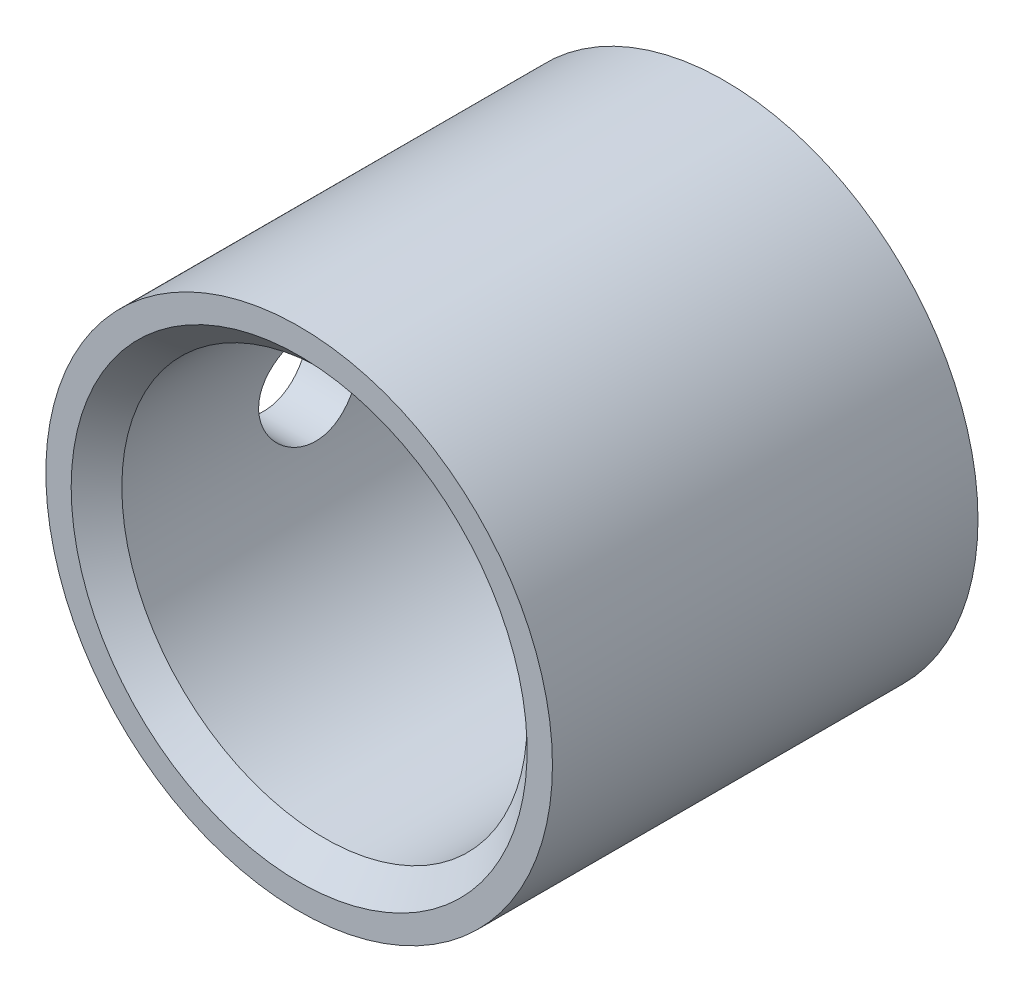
from build123d import *

# Parameters (mm, degrees)
ESQUISSE1_R             = 2.5
BASE_EXTRUSION_DEPTH    = 4.2
ESQUISSE2_R             = 2.25
ENL_V_MAT_EXTRU_1_DEPTH = 0.25
ENL_V_MAT_EXTRU_1_DRAFT = -45
ESQUISSE3_R             = 2
ENL_V_MAT_EXTRU_2_DEPTH = 3.7
ESQUISSE4_R             = 2.25
ENL_V_MAT_EXTRU_3_DEPTH = 0.25
ENL_V_MAT_EXTRU_3_DRAFT = -45
ESQUISSE5_R             = 0.5
ENL_V_MAT_EXTRU_4_DEPTH = 6.489990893


with BuildPart() as part:
    # Esquisse1 → Base-Extrusion (new body)
    with BuildSketch(Plane(origin=(0, 0, -4.2), x_dir=(-1, 0, 0), z_dir=(0, 0, -1))):
        with Locations(Location((0, 0, 0), (0, 0, 180))):
            Circle(ESQUISSE1_R)
    extrude(amount=-BASE_EXTRUSION_DEPTH)


with BuildPart() as enl_v_mat_extru_1_tool:
    # Esquisse2 → Enl_v. mat.-Extru.1 (with draft: the straight prism first)
    with BuildSketch(Plane(origin=(0, 0, -4.2), x_dir=(-1, 0, 0), z_dir=(0, 0, -1))):
        Circle(ESQUISSE2_R)
    extrude(amount=-ENL_V_MAT_EXTRU_1_DEPTH)
    # Enl_v. mat.-Extru.1: the draft: its side faces are tilted about the plane it starts from
    enl_v_mat_extru_1_sides = [enl_v_mat_extru_1_tool.faces().sort_by_distance(p)[0] for p in [
        (2.25, 0, -4.075),
    ]]
    draft(enl_v_mat_extru_1_sides, Plane(origin=(0, 0, -4.2), x_dir=(-1, 0, 0), z_dir=(0, 0, -1)), ENL_V_MAT_EXTRU_1_DRAFT)


with BuildPart() as part_1:
    add(part.part)

    # Enl_v. mat.-Extru.1: cut by enl_v_mat_extru_1_tool
    add(enl_v_mat_extru_1_tool.part, mode=Mode.SUBTRACT)

    # Esquisse3 → Enl_v. mat.-Extru.2 (cut)
    with BuildSketch(Plane(origin=(0, 0, -3.95), x_dir=(-1, 0, 0), z_dir=(0, 0, -1))):
        Circle(ESQUISSE3_R)
    extrude(amount=-ENL_V_MAT_EXTRU_2_DEPTH, mode=Mode.SUBTRACT)


with BuildPart() as enl_v_mat_extru_3_tool:
    # Esquisse4 → Enl_v. mat.-Extru.3 (with draft: the straight prism first)
    with BuildSketch(Plane.XY):
        Circle(ESQUISSE4_R)
    extrude(amount=-ENL_V_MAT_EXTRU_3_DEPTH)
    # Enl_v. mat.-Extru.3: the draft: its side faces are tilted about the plane it starts from
    enl_v_mat_extru_3_sides = [enl_v_mat_extru_3_tool.faces().sort_by_distance(p)[0] for p in [
        (-2.25, 0, -0.125),
    ]]
    draft(enl_v_mat_extru_3_sides, Plane.XY, ENL_V_MAT_EXTRU_3_DRAFT)


with BuildPart() as part_2:
    add(part_1.part)

    # Enl_v. mat.-Extru.3: cut by enl_v_mat_extru_3_tool
    add(enl_v_mat_extru_3_tool.part, mode=Mode.SUBTRACT)

    # Esquisse5 → Enl_v. mat.-Extru.4 (cut, through all)
    with BuildSketch(Plane(origin=(0, 0, 0), x_dir=(0, 0, -1), z_dir=(1, 0, 0))):
        with Locations((2.1, 0)):
            Circle(ESQUISSE5_R)
    extrude(amount=-ENL_V_MAT_EXTRU_4_DEPTH, mode=Mode.SUBTRACT)


solid = part_2.part
